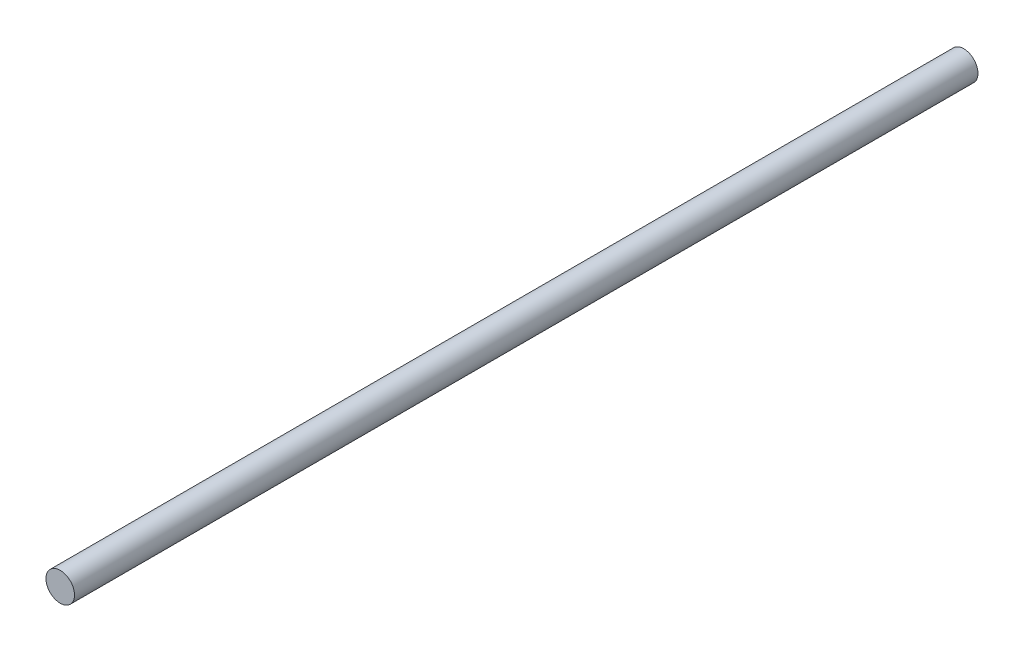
ISO-10303-21;
HEADER;
FILE_DESCRIPTION(('STEP AP214'),'2;1');
FILE_NAME('part.step','',(''),(''),'','','');
FILE_SCHEMA(('AUTOMOTIVE_DESIGN { 1 0 10303 214 1 1 1 1 }'));
ENDSEC;
DATA;
#1=APPLICATION_CONTEXT('core data for automotive mechanical design processes');
#2=APPLICATION_PROTOCOL_DEFINITION('international standard','automotive_design',2000,#1);
#3=PRODUCT_CONTEXT('',#1,'mechanical');
#4=PRODUCT('Part','Part','',(#3));
#5=PRODUCT_RELATED_PRODUCT_CATEGORY('part','',(#4));
#6=PRODUCT_DEFINITION_FORMATION('','',#4);
#7=PRODUCT_DEFINITION_CONTEXT('part definition',#1,'design');
#8=PRODUCT_DEFINITION('design','',#6,#7);
#9=PRODUCT_DEFINITION_SHAPE('','',#8);
#10=(LENGTH_UNIT() NAMED_UNIT(*) SI_UNIT(.MILLI.,.METRE.));
#11=(NAMED_UNIT(*) PLANE_ANGLE_UNIT() SI_UNIT($,.RADIAN.));
#12=(NAMED_UNIT(*) SI_UNIT($,.STERADIAN.) SOLID_ANGLE_UNIT());
#13=UNCERTAINTY_MEASURE_WITH_UNIT(LENGTH_MEASURE(1.E-05),#10,'distance_accuracy_value','');
#14=(GEOMETRIC_REPRESENTATION_CONTEXT(3) GLOBAL_UNCERTAINTY_ASSIGNED_CONTEXT((#13)) GLOBAL_UNIT_ASSIGNED_CONTEXT((#10,
#11,#12)) REPRESENTATION_CONTEXT('',''));
#15=CARTESIAN_POINT('',(0.,0.,0.));
#16=DIRECTION('',(0.,0.,1.));
#17=DIRECTION('',(1.,0.,0.));
#18=AXIS2_PLACEMENT_3D('',#15,#16,#17);
#19=CARTESIAN_POINT('',(0.,0.,-1900.));
#20=DIRECTION('',(0.,0.,1.));
#21=DIRECTION('',(1.,0.,0.));
#22=AXIS2_PLACEMENT_3D('',#19,#20,#21);
#23=CYLINDRICAL_SURFACE('',#22,30.);
#24=CARTESIAN_POINT('',(0.,0.,-1900.));
#25=DIRECTION('',(0.,0.,1.));
#26=DIRECTION('',(1.,0.,0.));
#27=AXIS2_PLACEMENT_3D('',#24,#25,#26);
#28=CIRCLE('',#27,30.);
#29=CARTESIAN_POINT('',(30.,0.,-1900.));
#30=VERTEX_POINT('',#29);
#31=EDGE_CURVE('E10',#30,#30,#28,.T.);
#32=CARTESIAN_POINT('',(0.,0.,0.));
#33=DIRECTION('',(0.,0.,1.));
#34=DIRECTION('',(1.,0.,0.));
#35=AXIS2_PLACEMENT_3D('',#32,#33,#34);
#36=CIRCLE('',#35,30.);
#37=CARTESIAN_POINT('',(30.,0.,-2.22044604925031E-13));
#38=VERTEX_POINT('',#37);
#39=EDGE_CURVE('E40',#38,#38,#36,.T.);
#40=CARTESIAN_POINT('',(30.,0.,-1900.));
#41=CARTESIAN_POINT('',(30.,0.,-1880.20833333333));
#42=CARTESIAN_POINT('',(30.,0.,-1860.41666666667));
#43=CARTESIAN_POINT('',(30.,0.,-1820.83333333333));
#44=CARTESIAN_POINT('',(30.,0.,-1801.04166666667));
#45=CARTESIAN_POINT('',(30.,0.,-1761.45833333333));
#46=CARTESIAN_POINT('',(30.,0.,-1741.66666666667));
#47=CARTESIAN_POINT('',(30.,0.,-1702.08333333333));
#48=CARTESIAN_POINT('',(30.,0.,-1682.29166666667));
#49=CARTESIAN_POINT('',(30.,0.,-1642.70833333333));
#50=CARTESIAN_POINT('',(30.,0.,-1622.91666666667));
#51=CARTESIAN_POINT('',(30.,0.,-1583.33333333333));
#52=CARTESIAN_POINT('',(30.,0.,-1563.54166666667));
#53=CARTESIAN_POINT('',(30.,0.,-1523.95833333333));
#54=CARTESIAN_POINT('',(30.,0.,-1504.16666666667));
#55=CARTESIAN_POINT('',(30.,0.,-1464.58333333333));
#56=CARTESIAN_POINT('',(30.,0.,-1444.79166666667));
#57=CARTESIAN_POINT('',(30.,0.,-1405.20833333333));
#58=CARTESIAN_POINT('',(30.,0.,-1385.41666666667));
#59=CARTESIAN_POINT('',(30.,0.,-1345.83333333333));
#60=CARTESIAN_POINT('',(30.,0.,-1326.04166666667));
#61=CARTESIAN_POINT('',(30.,0.,-1286.45833333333));
#62=CARTESIAN_POINT('',(30.,0.,-1266.66666666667));
#63=CARTESIAN_POINT('',(30.,0.,-1227.08333333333));
#64=CARTESIAN_POINT('',(30.,0.,-1207.29166666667));
#65=CARTESIAN_POINT('',(30.,0.,-1167.70833333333));
#66=CARTESIAN_POINT('',(30.,0.,-1147.91666666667));
#67=CARTESIAN_POINT('',(30.,0.,-1108.33333333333));
#68=CARTESIAN_POINT('',(30.,0.,-1088.54166666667));
#69=CARTESIAN_POINT('',(30.,0.,-1048.95833333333));
#70=CARTESIAN_POINT('',(30.,0.,-1029.16666666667));
#71=CARTESIAN_POINT('',(30.,0.,-989.583333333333));
#72=CARTESIAN_POINT('',(30.,0.,-969.791666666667));
#73=CARTESIAN_POINT('',(30.,0.,-930.208333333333));
#74=CARTESIAN_POINT('',(30.,0.,-910.416666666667));
#75=CARTESIAN_POINT('',(30.,0.,-870.833333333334));
#76=CARTESIAN_POINT('',(30.,0.,-851.041666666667));
#77=CARTESIAN_POINT('',(30.,0.,-811.458333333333));
#78=CARTESIAN_POINT('',(30.,0.,-791.666666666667));
#79=CARTESIAN_POINT('',(30.,0.,-752.083333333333));
#80=CARTESIAN_POINT('',(30.,0.,-732.291666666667));
#81=CARTESIAN_POINT('',(30.,0.,-692.708333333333));
#82=CARTESIAN_POINT('',(30.,0.,-672.916666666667));
#83=CARTESIAN_POINT('',(30.,0.,-633.333333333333));
#84=CARTESIAN_POINT('',(30.,0.,-613.541666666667));
#85=CARTESIAN_POINT('',(30.,0.,-573.958333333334));
#86=CARTESIAN_POINT('',(30.,0.,-554.166666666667));
#87=CARTESIAN_POINT('',(30.,0.,-514.583333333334));
#88=CARTESIAN_POINT('',(30.,0.,-494.791666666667));
#89=CARTESIAN_POINT('',(30.,0.,-455.208333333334));
#90=CARTESIAN_POINT('',(30.,0.,-435.416666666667));
#91=CARTESIAN_POINT('',(30.,0.,-395.833333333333));
#92=CARTESIAN_POINT('',(30.,0.,-376.041666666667));
#93=CARTESIAN_POINT('',(30.,0.,-336.458333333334));
#94=CARTESIAN_POINT('',(30.,0.,-316.666666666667));
#95=CARTESIAN_POINT('',(30.,0.,-277.083333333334));
#96=CARTESIAN_POINT('',(30.,0.,-257.291666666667));
#97=CARTESIAN_POINT('',(30.,0.,-217.708333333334));
#98=CARTESIAN_POINT('',(30.,0.,-197.916666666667));
#99=CARTESIAN_POINT('',(30.,0.,-158.333333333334));
#100=CARTESIAN_POINT('',(30.,0.,-138.541666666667));
#101=CARTESIAN_POINT('',(30.,0.,-98.9583333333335));
#102=CARTESIAN_POINT('',(30.,0.,-79.1666666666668));
#103=CARTESIAN_POINT('',(30.,0.,-39.5833333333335));
#104=CARTESIAN_POINT('',(30.,0.,-19.7916666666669));
#105=CARTESIAN_POINT('',(30.,0.,-2.22044604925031E-13));
#106=B_SPLINE_CURVE_WITH_KNOTS('',3,(#40,#41,#42,#43,#44,#45,#46,#47,#48,#49,#50,#51,#52,#53,
#54,#55,#56,#57,#58,#59,#60,#61,#62,#63,#64,#65,#66,#67,#68,#69,#70,#71,#72,#73,#74,#75,#76,#77,
#78,#79,#80,#81,#82,#83,#84,#85,#86,#87,#88,#89,#90,#91,#92,#93,#94,#95,#96,#97,#98,#99,#100,
#101,#102,#103,#104,#105),.UNSPECIFIED.,.F.,.F.,(4,2,2,2,2,2,2,2,2,2,2,2,2,2,2,2,2,2,2,2,2,2,2,
2,2,2,2,2,2,2,2,2,4),(0.,59.375,118.75,178.125,237.5,296.875,356.25,415.625,475.,534.375,593.75,
653.125,712.5,771.875,831.25,890.625,950.,1009.375,1068.75,1128.125,1187.5,1246.875,1306.25,
1365.625,1425.,1484.375,1543.75,1603.125,1662.5,1721.875,1781.25,1840.625,1900.),.UNSPECIFIED.);
#107=EDGE_CURVE('BSEAM37',#30,#38,#106,.T.);
#108=ORIENTED_EDGE('',*,*,#31,.T.);
#109=ORIENTED_EDGE('',*,*,#39,.F.);
#110=ORIENTED_EDGE('',*,*,#107,.T.);
#111=ORIENTED_EDGE('',*,*,#107,.F.);
#112=EDGE_LOOP('',(#108,#110,#109,#111));
#113=FACE_BOUND('',#112,.T.);
#114=ADVANCED_FACE('F37',(#113),#23,.T.);
#115=CARTESIAN_POINT('',(0.,0.,-1900.));
#116=DIRECTION('',(0.,0.,1.));
#117=DIRECTION('',(1.,0.,0.));
#118=AXIS2_PLACEMENT_3D('',#115,#116,#117);
#119=PLANE('',#118);
#120=ORIENTED_EDGE('',*,*,#31,.F.);
#121=EDGE_LOOP('',(#120));
#122=FACE_BOUND('',#121,.T.);
#123=ADVANCED_FACE('F54',(#122),#119,.F.);
#124=CARTESIAN_POINT('',(0.,0.,0.));
#125=DIRECTION('',(0.,0.,1.));
#126=DIRECTION('',(1.,0.,0.));
#127=AXIS2_PLACEMENT_3D('',#124,#125,#126);
#128=PLANE('',#127);
#129=ORIENTED_EDGE('',*,*,#39,.T.);
#130=EDGE_LOOP('',(#129));
#131=FACE_BOUND('',#130,.T.);
#132=ADVANCED_FACE('F51',(#131),#128,.T.);
#133=CLOSED_SHELL('',(#114,#123,#132));
#134=MANIFOLD_SOLID_BREP('B2',#133);
#135=ADVANCED_BREP_SHAPE_REPRESENTATION('',(#18,#134),#14);
#136=SHAPE_DEFINITION_REPRESENTATION(#9,#135);
ENDSEC;
END-ISO-10303-21;
